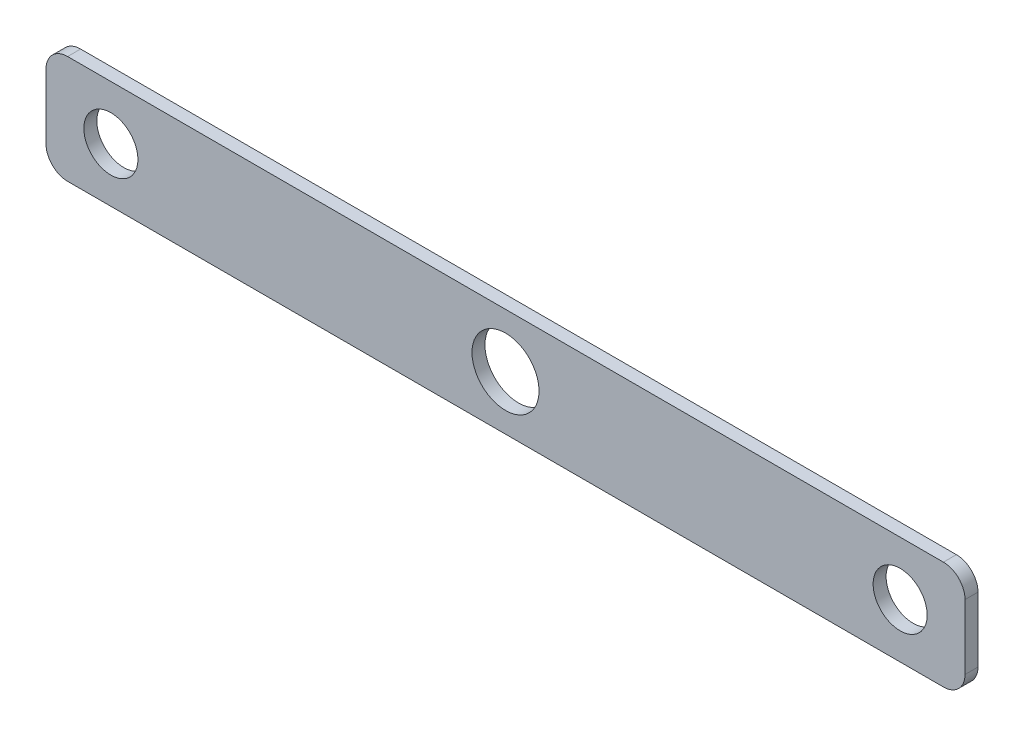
ISO-10303-21;
HEADER;
FILE_DESCRIPTION(('STEP AP214'),'2;1');
FILE_NAME('part.step','',(''),(''),'','','');
FILE_SCHEMA(('AUTOMOTIVE_DESIGN { 1 0 10303 214 1 1 1 1 }'));
ENDSEC;
DATA;
#1=APPLICATION_CONTEXT('core data for automotive mechanical design processes');
#2=APPLICATION_PROTOCOL_DEFINITION('international standard','automotive_design',2000,#1);
#3=PRODUCT_CONTEXT('',#1,'mechanical');
#4=PRODUCT('Part','Part','',(#3));
#5=PRODUCT_RELATED_PRODUCT_CATEGORY('part','',(#4));
#6=PRODUCT_DEFINITION_FORMATION('','',#4);
#7=PRODUCT_DEFINITION_CONTEXT('part definition',#1,'design');
#8=PRODUCT_DEFINITION('design','',#6,#7);
#9=PRODUCT_DEFINITION_SHAPE('','',#8);
#10=(LENGTH_UNIT() NAMED_UNIT(*) SI_UNIT(.MILLI.,.METRE.));
#11=(NAMED_UNIT(*) PLANE_ANGLE_UNIT() SI_UNIT($,.RADIAN.));
#12=(NAMED_UNIT(*) SI_UNIT($,.STERADIAN.) SOLID_ANGLE_UNIT());
#13=UNCERTAINTY_MEASURE_WITH_UNIT(LENGTH_MEASURE(1.E-05),#10,'distance_accuracy_value','');
#14=(GEOMETRIC_REPRESENTATION_CONTEXT(3) GLOBAL_UNCERTAINTY_ASSIGNED_CONTEXT((#13)) GLOBAL_UNIT_ASSIGNED_CONTEXT((#10,
#11,#12)) REPRESENTATION_CONTEXT('',''));
#15=CARTESIAN_POINT('',(0.,0.,0.));
#16=DIRECTION('',(0.,0.,1.));
#17=DIRECTION('',(1.,0.,0.));
#18=AXIS2_PLACEMENT_3D('',#15,#16,#17);
#19=CARTESIAN_POINT('',(-107.95,-12.7,1.524));
#20=DIRECTION('',(0.,0.,1.));
#21=DIRECTION('',(1.,0.,0.));
#22=AXIS2_PLACEMENT_3D('',#19,#20,#21);
#23=PLANE('',#22);
#24=CARTESIAN_POINT('',(0.,0.,1.524));
#25=DIRECTION('',(0.,0.,1.));
#26=DIRECTION('',(1.,0.,0.));
#27=AXIS2_PLACEMENT_3D('',#24,#25,#26);
#28=CIRCLE('',#27,7.87399999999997);
#29=CARTESIAN_POINT('',(-7.87399999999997,0.,1.524));
#30=VERTEX_POINT('',#29);
#31=EDGE_CURVE('E176',#30,#30,#28,.T.);
#32=ORIENTED_EDGE('',*,*,#31,.F.);
#33=EDGE_LOOP('',(#32));
#34=FACE_BOUND('',#33,.T.);
#35=DIRECTION('',(0.,1.,0.));
#36=VECTOR('',#35,1.);
#37=CARTESIAN_POINT('',(107.95,-12.7,1.524));
#38=LINE('',#37,#36);
#39=CARTESIAN_POINT('',(107.95,-7.61999999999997,1.524));
#40=VERTEX_POINT('',#39);
#41=CARTESIAN_POINT('',(107.95,7.62000000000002,1.524));
#42=VERTEX_POINT('',#41);
#43=EDGE_CURVE('E171',#40,#42,#38,.T.);
#44=ORIENTED_EDGE('',*,*,#43,.T.);
#45=CARTESIAN_POINT('',(102.87,7.62000000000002,1.524));
#46=DIRECTION('',(0.,0.,1.));
#47=DIRECTION('',(1.,0.,0.));
#48=AXIS2_PLACEMENT_3D('',#45,#46,#47);
#49=CIRCLE('',#48,5.08);
#50=CARTESIAN_POINT('',(102.87,12.7,1.524));
#51=VERTEX_POINT('',#50);
#52=EDGE_CURVE('E148',#42,#51,#49,.T.);
#53=ORIENTED_EDGE('',*,*,#52,.T.);
#54=DIRECTION('',(-1.,0.,0.));
#55=VECTOR('',#54,1.);
#56=CARTESIAN_POINT('',(107.95,12.7,1.524));
#57=LINE('',#56,#55);
#58=CARTESIAN_POINT('',(-102.87,12.7,1.524));
#59=VERTEX_POINT('',#58);
#60=EDGE_CURVE('E119',#51,#59,#57,.T.);
#61=ORIENTED_EDGE('',*,*,#60,.T.);
#62=CARTESIAN_POINT('',(-102.87,7.62,1.524));
#63=DIRECTION('',(0.,0.,1.));
#64=DIRECTION('',(1.,0.,0.));
#65=AXIS2_PLACEMENT_3D('',#62,#63,#64);
#66=CIRCLE('',#65,5.08);
#67=CARTESIAN_POINT('',(-107.95,7.62,1.524));
#68=VERTEX_POINT('',#67);
#69=EDGE_CURVE('E143',#59,#68,#66,.T.);
#70=ORIENTED_EDGE('',*,*,#69,.T.);
#71=DIRECTION('',(0.,-1.,0.));
#72=VECTOR('',#71,1.);
#73=CARTESIAN_POINT('',(-107.95,12.7,1.524));
#74=LINE('',#73,#72);
#75=CARTESIAN_POINT('',(-107.95,-7.61999999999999,1.524));
#76=VERTEX_POINT('',#75);
#77=EDGE_CURVE('E126',#68,#76,#74,.T.);
#78=ORIENTED_EDGE('',*,*,#77,.T.);
#79=CARTESIAN_POINT('',(-102.87,-7.61999999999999,1.524));
#80=DIRECTION('',(0.,0.,1.));
#81=DIRECTION('',(1.,0.,0.));
#82=AXIS2_PLACEMENT_3D('',#79,#80,#81);
#83=CIRCLE('',#82,5.08);
#84=CARTESIAN_POINT('',(-102.87,-12.7,1.524));
#85=VERTEX_POINT('',#84);
#86=EDGE_CURVE('E55',#76,#85,#83,.T.);
#87=ORIENTED_EDGE('',*,*,#86,.T.);
#88=DIRECTION('',(1.,0.,0.));
#89=VECTOR('',#88,1.);
#90=CARTESIAN_POINT('',(-107.95,-12.7,1.524));
#91=LINE('',#90,#89);
#92=CARTESIAN_POINT('',(102.87,-12.7,1.524));
#93=VERTEX_POINT('',#92);
#94=EDGE_CURVE('E129',#85,#93,#91,.T.);
#95=ORIENTED_EDGE('',*,*,#94,.T.);
#96=CARTESIAN_POINT('',(102.87,-7.61999999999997,1.524));
#97=DIRECTION('',(0.,0.,1.));
#98=DIRECTION('',(1.,0.,0.));
#99=AXIS2_PLACEMENT_3D('',#96,#97,#98);
#100=CIRCLE('',#99,5.08);
#101=EDGE_CURVE('E146',#93,#40,#100,.T.);
#102=ORIENTED_EDGE('',*,*,#101,.T.);
#103=EDGE_LOOP('',(#44,#53,#61,#70,#78,#87,#95,#102));
#104=FACE_BOUND('',#103,.T.);
#105=CARTESIAN_POINT('',(92.7100000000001,0.,1.524));
#106=DIRECTION('',(0.,0.,1.));
#107=DIRECTION('',(1.,0.,0.));
#108=AXIS2_PLACEMENT_3D('',#105,#106,#107);
#109=CIRCLE('',#108,6.35);
#110=CARTESIAN_POINT('',(86.3600000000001,0.,1.524));
#111=VERTEX_POINT('',#110);
#112=EDGE_CURVE('E164',#111,#111,#109,.T.);
#113=ORIENTED_EDGE('',*,*,#112,.F.);
#114=EDGE_LOOP('',(#113));
#115=FACE_BOUND('',#114,.T.);
#116=CARTESIAN_POINT('',(-92.71,0.,1.524));
#117=DIRECTION('',(0.,0.,1.));
#118=DIRECTION('',(1.,0.,0.));
#119=AXIS2_PLACEMENT_3D('',#116,#117,#118);
#120=CIRCLE('',#119,6.35);
#121=CARTESIAN_POINT('',(-99.06,0.,1.524));
#122=VERTEX_POINT('',#121);
#123=EDGE_CURVE('E181',#122,#122,#120,.T.);
#124=ORIENTED_EDGE('',*,*,#123,.F.);
#125=EDGE_LOOP('',(#124));
#126=FACE_BOUND('',#125,.T.);
#127=ADVANCED_FACE('F33',(#34,#104,#115,#126),#23,.T.);
#128=CARTESIAN_POINT('',(-107.95,-12.7,-1.524));
#129=DIRECTION('',(0.,0.,1.));
#130=DIRECTION('',(1.,0.,0.));
#131=AXIS2_PLACEMENT_3D('',#128,#129,#130);
#132=PLANE('',#131);
#133=CARTESIAN_POINT('',(0.,0.,-1.524));
#134=DIRECTION('',(0.,0.,1.));
#135=DIRECTION('',(1.,0.,0.));
#136=AXIS2_PLACEMENT_3D('',#133,#134,#135);
#137=CIRCLE('',#136,7.87399999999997);
#138=CARTESIAN_POINT('',(-7.87399999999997,0.,-1.524));
#139=VERTEX_POINT('',#138);
#140=EDGE_CURVE('E178',#139,#139,#137,.T.);
#141=ORIENTED_EDGE('',*,*,#140,.T.);
#142=EDGE_LOOP('',(#141));
#143=FACE_BOUND('',#142,.T.);
#144=DIRECTION('',(-1.,0.,0.));
#145=VECTOR('',#144,1.);
#146=CARTESIAN_POINT('',(107.95,12.7,-1.524));
#147=LINE('',#146,#145);
#148=CARTESIAN_POINT('',(102.87,12.7,-1.524));
#149=VERTEX_POINT('',#148);
#150=CARTESIAN_POINT('',(-102.87,12.7,-1.524));
#151=VERTEX_POINT('',#150);
#152=EDGE_CURVE('E116',#149,#151,#147,.T.);
#153=ORIENTED_EDGE('',*,*,#152,.F.);
#154=CARTESIAN_POINT('',(102.87,7.62000000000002,-1.524));
#155=DIRECTION('',(0.,0.,1.));
#156=DIRECTION('',(1.,0.,0.));
#157=AXIS2_PLACEMENT_3D('',#154,#155,#156);
#158=CIRCLE('',#157,5.08);
#159=CARTESIAN_POINT('',(107.95,7.62000000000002,-1.524));
#160=VERTEX_POINT('',#159);
#161=EDGE_CURVE('E99',#149,#160,#158,.F.);
#162=ORIENTED_EDGE('',*,*,#161,.T.);
#163=DIRECTION('',(0.,1.,0.));
#164=VECTOR('',#163,1.);
#165=CARTESIAN_POINT('',(107.95,-12.7,-1.524));
#166=LINE('',#165,#164);
#167=CARTESIAN_POINT('',(107.95,-7.61999999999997,-1.524));
#168=VERTEX_POINT('',#167);
#169=EDGE_CURVE('E127',#168,#160,#166,.T.);
#170=ORIENTED_EDGE('',*,*,#169,.F.);
#171=CARTESIAN_POINT('',(102.87,-7.61999999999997,-1.524));
#172=DIRECTION('',(0.,0.,1.));
#173=DIRECTION('',(1.,0.,0.));
#174=AXIS2_PLACEMENT_3D('',#171,#172,#173);
#175=CIRCLE('',#174,5.08);
#176=CARTESIAN_POINT('',(102.87,-12.7,-1.524));
#177=VERTEX_POINT('',#176);
#178=EDGE_CURVE('E110',#168,#177,#175,.F.);
#179=ORIENTED_EDGE('',*,*,#178,.T.);
#180=DIRECTION('',(1.,0.,0.));
#181=VECTOR('',#180,1.);
#182=CARTESIAN_POINT('',(-107.95,-12.7,-1.524));
#183=LINE('',#182,#181);
#184=CARTESIAN_POINT('',(-102.87,-12.7,-1.524));
#185=VERTEX_POINT('',#184);
#186=EDGE_CURVE('E131',#185,#177,#183,.T.);
#187=ORIENTED_EDGE('',*,*,#186,.F.);
#188=CARTESIAN_POINT('',(-102.87,-7.61999999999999,-1.524));
#189=DIRECTION('',(0.,0.,1.));
#190=DIRECTION('',(1.,0.,0.));
#191=AXIS2_PLACEMENT_3D('',#188,#189,#190);
#192=CIRCLE('',#191,5.08);
#193=CARTESIAN_POINT('',(-107.95,-7.61999999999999,-1.524));
#194=VERTEX_POINT('',#193);
#195=EDGE_CURVE('E137',#185,#194,#192,.F.);
#196=ORIENTED_EDGE('',*,*,#195,.T.);
#197=DIRECTION('',(0.,-1.,0.));
#198=VECTOR('',#197,1.);
#199=CARTESIAN_POINT('',(-107.95,12.7,-1.524));
#200=LINE('',#199,#198);
#201=CARTESIAN_POINT('',(-107.95,7.62,-1.524));
#202=VERTEX_POINT('',#201);
#203=EDGE_CURVE('E159',#202,#194,#200,.T.);
#204=ORIENTED_EDGE('',*,*,#203,.F.);
#205=CARTESIAN_POINT('',(-102.87,7.62,-1.524));
#206=DIRECTION('',(0.,0.,1.));
#207=DIRECTION('',(1.,0.,0.));
#208=AXIS2_PLACEMENT_3D('',#205,#206,#207);
#209=CIRCLE('',#208,5.08);
#210=EDGE_CURVE('E120',#202,#151,#209,.F.);
#211=ORIENTED_EDGE('',*,*,#210,.T.);
#212=EDGE_LOOP('',(#153,#162,#170,#179,#187,#196,#204,#211));
#213=FACE_BOUND('',#212,.T.);
#214=CARTESIAN_POINT('',(92.7100000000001,0.,-1.524));
#215=DIRECTION('',(0.,0.,1.));
#216=DIRECTION('',(1.,0.,0.));
#217=AXIS2_PLACEMENT_3D('',#214,#215,#216);
#218=CIRCLE('',#217,6.35);
#219=CARTESIAN_POINT('',(86.3600000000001,0.,-1.524));
#220=VERTEX_POINT('',#219);
#221=EDGE_CURVE('E167',#220,#220,#218,.T.);
#222=ORIENTED_EDGE('',*,*,#221,.T.);
#223=EDGE_LOOP('',(#222));
#224=FACE_BOUND('',#223,.T.);
#225=CARTESIAN_POINT('',(-92.71,0.,-1.524));
#226=DIRECTION('',(0.,0.,1.));
#227=DIRECTION('',(1.,0.,0.));
#228=AXIS2_PLACEMENT_3D('',#225,#226,#227);
#229=CIRCLE('',#228,6.35);
#230=CARTESIAN_POINT('',(-99.06,0.,-1.524));
#231=VERTEX_POINT('',#230);
#232=EDGE_CURVE('E184',#231,#231,#229,.T.);
#233=ORIENTED_EDGE('',*,*,#232,.T.);
#234=EDGE_LOOP('',(#233));
#235=FACE_BOUND('',#234,.T.);
#236=ADVANCED_FACE('F123',(#143,#213,#224,#235),#132,.F.);
#237=CARTESIAN_POINT('',(-107.95,12.7,1.524));
#238=DIRECTION('',(1.,0.,0.));
#239=DIRECTION('',(0.,0.,-1.));
#240=AXIS2_PLACEMENT_3D('',#237,#238,#239);
#241=PLANE('',#240);
#242=ORIENTED_EDGE('',*,*,#203,.T.);
#243=DIRECTION('',(0.,0.,-1.));
#244=VECTOR('',#243,1.);
#245=CARTESIAN_POINT('',(-107.95,-7.61999999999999,1.524));
#246=LINE('',#245,#244);
#247=EDGE_CURVE('E11',#194,#76,#246,.F.);
#248=ORIENTED_EDGE('',*,*,#247,.T.);
#249=ORIENTED_EDGE('',*,*,#77,.F.);
#250=DIRECTION('',(0.,0.,-1.));
#251=VECTOR('',#250,1.);
#252=CARTESIAN_POINT('',(-107.95,7.62,1.524));
#253=LINE('',#252,#251);
#254=EDGE_CURVE('E41',#68,#202,#253,.T.);
#255=ORIENTED_EDGE('',*,*,#254,.T.);
#256=EDGE_LOOP('',(#242,#248,#249,#255));
#257=FACE_BOUND('',#256,.T.);
#258=ADVANCED_FACE('F158',(#257),#241,.F.);
#259=CARTESIAN_POINT('',(-107.95,-12.7,1.524));
#260=DIRECTION('',(0.,1.,0.));
#261=DIRECTION('',(-1.,0.,0.));
#262=AXIS2_PLACEMENT_3D('',#259,#260,#261);
#263=PLANE('',#262);
#264=ORIENTED_EDGE('',*,*,#186,.T.);
#265=DIRECTION('',(0.,0.,-1.));
#266=VECTOR('',#265,1.);
#267=CARTESIAN_POINT('',(102.87,-12.7,1.524));
#268=LINE('',#267,#266);
#269=EDGE_CURVE('E48',#177,#93,#268,.F.);
#270=ORIENTED_EDGE('',*,*,#269,.T.);
#271=ORIENTED_EDGE('',*,*,#94,.F.);
#272=DIRECTION('',(0.,0.,-1.));
#273=VECTOR('',#272,1.);
#274=CARTESIAN_POINT('',(-102.87,-12.7,1.524));
#275=LINE('',#274,#273);
#276=EDGE_CURVE('E150',#85,#185,#275,.T.);
#277=ORIENTED_EDGE('',*,*,#276,.T.);
#278=EDGE_LOOP('',(#264,#270,#271,#277));
#279=FACE_BOUND('',#278,.T.);
#280=ADVANCED_FACE('F211',(#279),#263,.F.);
#281=CARTESIAN_POINT('',(107.95,-12.7,1.524));
#282=DIRECTION('',(-1.,0.,0.));
#283=DIRECTION('',(0.,-1.,0.));
#284=AXIS2_PLACEMENT_3D('',#281,#282,#283);
#285=PLANE('',#284);
#286=ORIENTED_EDGE('',*,*,#169,.T.);
#287=DIRECTION('',(0.,0.,-1.));
#288=VECTOR('',#287,1.);
#289=CARTESIAN_POINT('',(107.95,7.62000000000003,1.524));
#290=LINE('',#289,#288);
#291=EDGE_CURVE('E104',#160,#42,#290,.F.);
#292=ORIENTED_EDGE('',*,*,#291,.T.);
#293=ORIENTED_EDGE('',*,*,#43,.F.);
#294=DIRECTION('',(0.,0.,-1.));
#295=VECTOR('',#294,1.);
#296=CARTESIAN_POINT('',(107.95,-7.61999999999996,1.524));
#297=LINE('',#296,#295);
#298=EDGE_CURVE('E109',#40,#168,#297,.T.);
#299=ORIENTED_EDGE('',*,*,#298,.T.);
#300=EDGE_LOOP('',(#286,#292,#293,#299));
#301=FACE_BOUND('',#300,.T.);
#302=ADVANCED_FACE('F208',(#301),#285,.F.);
#303=CARTESIAN_POINT('',(107.95,12.7,1.524));
#304=DIRECTION('',(0.,-1.,0.));
#305=DIRECTION('',(1.,0.,0.));
#306=AXIS2_PLACEMENT_3D('',#303,#304,#305);
#307=PLANE('',#306);
#308=ORIENTED_EDGE('',*,*,#60,.F.);
#309=DIRECTION('',(0.,0.,-1.));
#310=VECTOR('',#309,1.);
#311=CARTESIAN_POINT('',(102.87,12.7,1.524));
#312=LINE('',#311,#310);
#313=EDGE_CURVE('E103',#51,#149,#312,.T.);
#314=ORIENTED_EDGE('',*,*,#313,.T.);
#315=ORIENTED_EDGE('',*,*,#152,.T.);
#316=DIRECTION('',(0.,0.,-1.));
#317=VECTOR('',#316,1.);
#318=CARTESIAN_POINT('',(-102.87,12.7,1.524));
#319=LINE('',#318,#317);
#320=EDGE_CURVE('E121',#151,#59,#319,.F.);
#321=ORIENTED_EDGE('',*,*,#320,.T.);
#322=EDGE_LOOP('',(#308,#314,#315,#321));
#323=FACE_BOUND('',#322,.T.);
#324=ADVANCED_FACE('F115',(#323),#307,.F.);
#325=CARTESIAN_POINT('',(92.7100000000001,0.,1.524));
#326=DIRECTION('',(0.,0.,-1.));
#327=DIRECTION('',(-1.,0.,0.));
#328=AXIS2_PLACEMENT_3D('',#325,#326,#327);
#329=CYLINDRICAL_SURFACE('',#328,6.35);
#330=CARTESIAN_POINT('',(86.3600000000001,0.,1.524));
#331=CARTESIAN_POINT('',(86.3600000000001,0.,1.49225));
#332=CARTESIAN_POINT('',(86.3600000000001,0.,1.4605));
#333=CARTESIAN_POINT('',(86.3600000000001,0.,1.397));
#334=CARTESIAN_POINT('',(86.3600000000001,0.,1.36525));
#335=CARTESIAN_POINT('',(86.3600000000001,0.,1.30175));
#336=CARTESIAN_POINT('',(86.3600000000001,0.,1.27));
#337=CARTESIAN_POINT('',(86.3600000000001,0.,1.2065));
#338=CARTESIAN_POINT('',(86.3600000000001,0.,1.17475));
#339=CARTESIAN_POINT('',(86.3600000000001,0.,1.11125));
#340=CARTESIAN_POINT('',(86.3600000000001,0.,1.0795));
#341=CARTESIAN_POINT('',(86.3600000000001,0.,1.016));
#342=CARTESIAN_POINT('',(86.3600000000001,0.,0.98425));
#343=CARTESIAN_POINT('',(86.3600000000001,0.,0.92075));
#344=CARTESIAN_POINT('',(86.3600000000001,0.,0.889));
#345=CARTESIAN_POINT('',(86.3600000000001,0.,0.8255));
#346=CARTESIAN_POINT('',(86.3600000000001,0.,0.79375));
#347=CARTESIAN_POINT('',(86.3600000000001,0.,0.73025));
#348=CARTESIAN_POINT('',(86.3600000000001,0.,0.6985));
#349=CARTESIAN_POINT('',(86.3600000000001,0.,0.635));
#350=CARTESIAN_POINT('',(86.3600000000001,0.,0.60325));
#351=CARTESIAN_POINT('',(86.3600000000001,0.,0.53975));
#352=CARTESIAN_POINT('',(86.3600000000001,0.,0.508));
#353=CARTESIAN_POINT('',(86.3600000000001,0.,0.4445));
#354=CARTESIAN_POINT('',(86.3600000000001,0.,0.41275));
#355=CARTESIAN_POINT('',(86.3600000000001,0.,0.34925));
#356=CARTESIAN_POINT('',(86.3600000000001,0.,0.3175));
#357=CARTESIAN_POINT('',(86.3600000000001,0.,0.254));
#358=CARTESIAN_POINT('',(86.3600000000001,0.,0.22225));
#359=CARTESIAN_POINT('',(86.3600000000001,0.,0.15875));
#360=CARTESIAN_POINT('',(86.3600000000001,0.,0.127));
#361=CARTESIAN_POINT('',(86.3600000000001,0.,0.0634999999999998));
#362=CARTESIAN_POINT('',(86.3600000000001,0.,0.0317499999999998));
#363=CARTESIAN_POINT('',(86.3600000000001,0.,-0.0317500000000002));
#364=CARTESIAN_POINT('',(86.3600000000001,0.,-0.0635000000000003));
#365=CARTESIAN_POINT('',(86.3600000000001,0.,-0.127));
#366=CARTESIAN_POINT('',(86.3600000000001,0.,-0.15875));
#367=CARTESIAN_POINT('',(86.3600000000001,0.,-0.22225));
#368=CARTESIAN_POINT('',(86.3600000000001,0.,-0.254));
#369=CARTESIAN_POINT('',(86.3600000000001,0.,-0.3175));
#370=CARTESIAN_POINT('',(86.3600000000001,0.,-0.34925));
#371=CARTESIAN_POINT('',(86.3600000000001,0.,-0.41275));
#372=CARTESIAN_POINT('',(86.3600000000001,0.,-0.4445));
#373=CARTESIAN_POINT('',(86.3600000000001,0.,-0.508));
#374=CARTESIAN_POINT('',(86.3600000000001,0.,-0.53975));
#375=CARTESIAN_POINT('',(86.3600000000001,0.,-0.60325));
#376=CARTESIAN_POINT('',(86.3600000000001,0.,-0.635));
#377=CARTESIAN_POINT('',(86.3600000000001,0.,-0.6985));
#378=CARTESIAN_POINT('',(86.3600000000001,0.,-0.73025));
#379=CARTESIAN_POINT('',(86.3600000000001,0.,-0.79375));
#380=CARTESIAN_POINT('',(86.3600000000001,0.,-0.8255));
#381=CARTESIAN_POINT('',(86.3600000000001,0.,-0.889));
#382=CARTESIAN_POINT('',(86.3600000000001,0.,-0.92075));
#383=CARTESIAN_POINT('',(86.3600000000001,0.,-0.98425));
#384=CARTESIAN_POINT('',(86.3600000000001,0.,-1.016));
#385=CARTESIAN_POINT('',(86.3600000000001,0.,-1.0795));
#386=CARTESIAN_POINT('',(86.3600000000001,0.,-1.11125));
#387=CARTESIAN_POINT('',(86.3600000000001,0.,-1.17475));
#388=CARTESIAN_POINT('',(86.3600000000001,0.,-1.2065));
#389=CARTESIAN_POINT('',(86.3600000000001,0.,-1.27));
#390=CARTESIAN_POINT('',(86.3600000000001,0.,-1.30175));
#391=CARTESIAN_POINT('',(86.3600000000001,0.,-1.36525));
#392=CARTESIAN_POINT('',(86.3600000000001,0.,-1.397));
#393=CARTESIAN_POINT('',(86.3600000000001,0.,-1.4605));
#394=CARTESIAN_POINT('',(86.3600000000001,0.,-1.49225));
#395=CARTESIAN_POINT('',(86.3600000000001,0.,-1.524));
#396=B_SPLINE_CURVE_WITH_KNOTS('',3,(#330,#331,#332,#333,#334,#335,#336,#337,#338,#339,#340,
#341,#342,#343,#344,#345,#346,#347,#348,#349,#350,#351,#352,#353,#354,#355,#356,#357,#358,#359,
#360,#361,#362,#363,#364,#365,#366,#367,#368,#369,#370,#371,#372,#373,#374,#375,#376,#377,#378,
#379,#380,#381,#382,#383,#384,#385,#386,#387,#388,#389,#390,#391,#392,#393,#394,#395),
.UNSPECIFIED.,.F.,.F.,(4,2,2,2,2,2,2,2,2,2,2,2,2,2,2,2,2,2,2,2,2,2,2,2,2,2,2,2,2,2,2,2,4),(0.,
0.0952499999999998,0.1905,0.28575,0.381,0.47625,0.5715,0.66675,0.762,0.85725,0.9525,1.04775,
1.143,1.23825,1.3335,1.42875,1.524,1.61925,1.7145,1.80975,1.905,2.00025,2.0955,2.19075,2.286,
2.38125,2.4765,2.57175,2.667,2.76225,2.8575,2.95275,3.048),.UNSPECIFIED.);
#397=EDGE_CURVE('BSEAM203',#111,#220,#396,.T.);
#398=ORIENTED_EDGE('',*,*,#112,.T.);
#399=ORIENTED_EDGE('',*,*,#221,.F.);
#400=ORIENTED_EDGE('',*,*,#397,.T.);
#401=ORIENTED_EDGE('',*,*,#397,.F.);
#402=EDGE_LOOP('',(#398,#400,#399,#401));
#403=FACE_BOUND('',#402,.T.);
#404=ADVANCED_FACE('F203',(#403),#329,.F.);
#405=CARTESIAN_POINT('',(0.,0.,1.524));
#406=DIRECTION('',(0.,0.,-1.));
#407=DIRECTION('',(-1.,0.,0.));
#408=AXIS2_PLACEMENT_3D('',#405,#406,#407);
#409=CYLINDRICAL_SURFACE('',#408,7.87399999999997);
#410=CARTESIAN_POINT('',(-7.87399999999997,0.,1.524));
#411=CARTESIAN_POINT('',(-7.87399999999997,0.,1.49225));
#412=CARTESIAN_POINT('',(-7.87399999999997,0.,1.4605));
#413=CARTESIAN_POINT('',(-7.87399999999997,0.,1.397));
#414=CARTESIAN_POINT('',(-7.87399999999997,0.,1.36525));
#415=CARTESIAN_POINT('',(-7.87399999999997,0.,1.30175));
#416=CARTESIAN_POINT('',(-7.87399999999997,0.,1.27));
#417=CARTESIAN_POINT('',(-7.87399999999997,0.,1.2065));
#418=CARTESIAN_POINT('',(-7.87399999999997,0.,1.17475));
#419=CARTESIAN_POINT('',(-7.87399999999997,0.,1.11125));
#420=CARTESIAN_POINT('',(-7.87399999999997,0.,1.0795));
#421=CARTESIAN_POINT('',(-7.87399999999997,0.,1.016));
#422=CARTESIAN_POINT('',(-7.87399999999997,0.,0.98425));
#423=CARTESIAN_POINT('',(-7.87399999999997,0.,0.92075));
#424=CARTESIAN_POINT('',(-7.87399999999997,0.,0.889));
#425=CARTESIAN_POINT('',(-7.87399999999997,0.,0.8255));
#426=CARTESIAN_POINT('',(-7.87399999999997,0.,0.79375));
#427=CARTESIAN_POINT('',(-7.87399999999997,0.,0.73025));
#428=CARTESIAN_POINT('',(-7.87399999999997,0.,0.6985));
#429=CARTESIAN_POINT('',(-7.87399999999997,0.,0.635));
#430=CARTESIAN_POINT('',(-7.87399999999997,0.,0.60325));
#431=CARTESIAN_POINT('',(-7.87399999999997,0.,0.53975));
#432=CARTESIAN_POINT('',(-7.87399999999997,0.,0.508));
#433=CARTESIAN_POINT('',(-7.87399999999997,0.,0.4445));
#434=CARTESIAN_POINT('',(-7.87399999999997,0.,0.41275));
#435=CARTESIAN_POINT('',(-7.87399999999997,0.,0.34925));
#436=CARTESIAN_POINT('',(-7.87399999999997,0.,0.3175));
#437=CARTESIAN_POINT('',(-7.87399999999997,0.,0.254));
#438=CARTESIAN_POINT('',(-7.87399999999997,0.,0.22225));
#439=CARTESIAN_POINT('',(-7.87399999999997,0.,0.15875));
#440=CARTESIAN_POINT('',(-7.87399999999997,0.,0.127));
#441=CARTESIAN_POINT('',(-7.87399999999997,0.,0.0635000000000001));
#442=CARTESIAN_POINT('',(-7.87399999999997,0.,0.03175));
#443=CARTESIAN_POINT('',(-7.87399999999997,0.,-0.03175));
#444=CARTESIAN_POINT('',(-7.87399999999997,0.,-0.0635000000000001));
#445=CARTESIAN_POINT('',(-7.87399999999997,0.,-0.127));
#446=CARTESIAN_POINT('',(-7.87399999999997,0.,-0.15875));
#447=CARTESIAN_POINT('',(-7.87399999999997,0.,-0.22225));
#448=CARTESIAN_POINT('',(-7.87399999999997,0.,-0.254));
#449=CARTESIAN_POINT('',(-7.87399999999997,0.,-0.3175));
#450=CARTESIAN_POINT('',(-7.87399999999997,0.,-0.34925));
#451=CARTESIAN_POINT('',(-7.87399999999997,0.,-0.41275));
#452=CARTESIAN_POINT('',(-7.87399999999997,0.,-0.4445));
#453=CARTESIAN_POINT('',(-7.87399999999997,0.,-0.508));
#454=CARTESIAN_POINT('',(-7.87399999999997,0.,-0.53975));
#455=CARTESIAN_POINT('',(-7.87399999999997,0.,-0.60325));
#456=CARTESIAN_POINT('',(-7.87399999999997,0.,-0.635));
#457=CARTESIAN_POINT('',(-7.87399999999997,0.,-0.6985));
#458=CARTESIAN_POINT('',(-7.87399999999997,0.,-0.73025));
#459=CARTESIAN_POINT('',(-7.87399999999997,0.,-0.79375));
#460=CARTESIAN_POINT('',(-7.87399999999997,0.,-0.8255));
#461=CARTESIAN_POINT('',(-7.87399999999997,0.,-0.889));
#462=CARTESIAN_POINT('',(-7.87399999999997,0.,-0.92075));
#463=CARTESIAN_POINT('',(-7.87399999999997,0.,-0.98425));
#464=CARTESIAN_POINT('',(-7.87399999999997,0.,-1.016));
#465=CARTESIAN_POINT('',(-7.87399999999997,0.,-1.0795));
#466=CARTESIAN_POINT('',(-7.87399999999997,0.,-1.11125));
#467=CARTESIAN_POINT('',(-7.87399999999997,0.,-1.17475));
#468=CARTESIAN_POINT('',(-7.87399999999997,0.,-1.2065));
#469=CARTESIAN_POINT('',(-7.87399999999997,0.,-1.27));
#470=CARTESIAN_POINT('',(-7.87399999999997,0.,-1.30175));
#471=CARTESIAN_POINT('',(-7.87399999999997,0.,-1.36525));
#472=CARTESIAN_POINT('',(-7.87399999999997,0.,-1.397));
#473=CARTESIAN_POINT('',(-7.87399999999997,0.,-1.4605));
#474=CARTESIAN_POINT('',(-7.87399999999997,0.,-1.49225));
#475=CARTESIAN_POINT('',(-7.87399999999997,0.,-1.524));
#476=B_SPLINE_CURVE_WITH_KNOTS('',3,(#410,#411,#412,#413,#414,#415,#416,#417,#418,#419,#420,
#421,#422,#423,#424,#425,#426,#427,#428,#429,#430,#431,#432,#433,#434,#435,#436,#437,#438,#439,
#440,#441,#442,#443,#444,#445,#446,#447,#448,#449,#450,#451,#452,#453,#454,#455,#456,#457,#458,
#459,#460,#461,#462,#463,#464,#465,#466,#467,#468,#469,#470,#471,#472,#473,#474,#475),
.UNSPECIFIED.,.F.,.F.,(4,2,2,2,2,2,2,2,2,2,2,2,2,2,2,2,2,2,2,2,2,2,2,2,2,2,2,2,2,2,2,2,4),(0.,
0.0952500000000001,0.1905,0.28575,0.381,0.47625,0.5715,0.66675,0.762,0.85725,0.9525,1.04775,
1.143,1.23825,1.3335,1.42875,1.524,1.61925,1.7145,1.80975,1.905,2.00025,2.0955,2.19075,2.286,
2.38125,2.4765,2.57175,2.667,2.76225,2.8575,2.95275,3.048),.UNSPECIFIED.);
#477=EDGE_CURVE('BSEAM237',#30,#139,#476,.T.);
#478=ORIENTED_EDGE('',*,*,#31,.T.);
#479=ORIENTED_EDGE('',*,*,#140,.F.);
#480=ORIENTED_EDGE('',*,*,#477,.T.);
#481=ORIENTED_EDGE('',*,*,#477,.F.);
#482=EDGE_LOOP('',(#478,#480,#479,#481));
#483=FACE_BOUND('',#482,.T.);
#484=ADVANCED_FACE('F237',(#483),#409,.F.);
#485=CARTESIAN_POINT('',(-92.71,0.,1.524));
#486=DIRECTION('',(0.,0.,-1.));
#487=DIRECTION('',(-1.,0.,0.));
#488=AXIS2_PLACEMENT_3D('',#485,#486,#487);
#489=CYLINDRICAL_SURFACE('',#488,6.35);
#490=CARTESIAN_POINT('',(-99.06,0.,1.524));
#491=CARTESIAN_POINT('',(-99.06,0.,1.49225));
#492=CARTESIAN_POINT('',(-99.06,0.,1.4605));
#493=CARTESIAN_POINT('',(-99.06,0.,1.397));
#494=CARTESIAN_POINT('',(-99.06,0.,1.36525));
#495=CARTESIAN_POINT('',(-99.06,0.,1.30175));
#496=CARTESIAN_POINT('',(-99.06,0.,1.27));
#497=CARTESIAN_POINT('',(-99.06,0.,1.2065));
#498=CARTESIAN_POINT('',(-99.06,0.,1.17475));
#499=CARTESIAN_POINT('',(-99.06,0.,1.11125));
#500=CARTESIAN_POINT('',(-99.06,0.,1.0795));
#501=CARTESIAN_POINT('',(-99.06,0.,1.016));
#502=CARTESIAN_POINT('',(-99.06,0.,0.98425));
#503=CARTESIAN_POINT('',(-99.06,0.,0.92075));
#504=CARTESIAN_POINT('',(-99.06,0.,0.889));
#505=CARTESIAN_POINT('',(-99.06,0.,0.8255));
#506=CARTESIAN_POINT('',(-99.06,0.,0.79375));
#507=CARTESIAN_POINT('',(-99.06,0.,0.73025));
#508=CARTESIAN_POINT('',(-99.06,0.,0.6985));
#509=CARTESIAN_POINT('',(-99.06,0.,0.635));
#510=CARTESIAN_POINT('',(-99.06,0.,0.60325));
#511=CARTESIAN_POINT('',(-99.06,0.,0.53975));
#512=CARTESIAN_POINT('',(-99.06,0.,0.508));
#513=CARTESIAN_POINT('',(-99.06,0.,0.4445));
#514=CARTESIAN_POINT('',(-99.06,0.,0.41275));
#515=CARTESIAN_POINT('',(-99.06,0.,0.34925));
#516=CARTESIAN_POINT('',(-99.06,0.,0.3175));
#517=CARTESIAN_POINT('',(-99.06,0.,0.254));
#518=CARTESIAN_POINT('',(-99.06,0.,0.22225));
#519=CARTESIAN_POINT('',(-99.06,0.,0.15875));
#520=CARTESIAN_POINT('',(-99.06,0.,0.127));
#521=CARTESIAN_POINT('',(-99.06,0.,0.0634999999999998));
#522=CARTESIAN_POINT('',(-99.06,0.,0.0317499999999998));
#523=CARTESIAN_POINT('',(-99.06,0.,-0.0317500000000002));
#524=CARTESIAN_POINT('',(-99.06,0.,-0.0635000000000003));
#525=CARTESIAN_POINT('',(-99.06,0.,-0.127));
#526=CARTESIAN_POINT('',(-99.06,0.,-0.15875));
#527=CARTESIAN_POINT('',(-99.06,0.,-0.22225));
#528=CARTESIAN_POINT('',(-99.06,0.,-0.254));
#529=CARTESIAN_POINT('',(-99.06,0.,-0.3175));
#530=CARTESIAN_POINT('',(-99.06,0.,-0.34925));
#531=CARTESIAN_POINT('',(-99.06,0.,-0.41275));
#532=CARTESIAN_POINT('',(-99.06,0.,-0.4445));
#533=CARTESIAN_POINT('',(-99.06,0.,-0.508));
#534=CARTESIAN_POINT('',(-99.06,0.,-0.53975));
#535=CARTESIAN_POINT('',(-99.06,0.,-0.60325));
#536=CARTESIAN_POINT('',(-99.06,0.,-0.635));
#537=CARTESIAN_POINT('',(-99.06,0.,-0.6985));
#538=CARTESIAN_POINT('',(-99.06,0.,-0.73025));
#539=CARTESIAN_POINT('',(-99.06,0.,-0.79375));
#540=CARTESIAN_POINT('',(-99.06,0.,-0.8255));
#541=CARTESIAN_POINT('',(-99.06,0.,-0.889));
#542=CARTESIAN_POINT('',(-99.06,0.,-0.92075));
#543=CARTESIAN_POINT('',(-99.06,0.,-0.98425));
#544=CARTESIAN_POINT('',(-99.06,0.,-1.016));
#545=CARTESIAN_POINT('',(-99.06,0.,-1.0795));
#546=CARTESIAN_POINT('',(-99.06,0.,-1.11125));
#547=CARTESIAN_POINT('',(-99.06,0.,-1.17475));
#548=CARTESIAN_POINT('',(-99.06,0.,-1.2065));
#549=CARTESIAN_POINT('',(-99.06,0.,-1.27));
#550=CARTESIAN_POINT('',(-99.06,0.,-1.30175));
#551=CARTESIAN_POINT('',(-99.06,0.,-1.36525));
#552=CARTESIAN_POINT('',(-99.06,0.,-1.397));
#553=CARTESIAN_POINT('',(-99.06,0.,-1.4605));
#554=CARTESIAN_POINT('',(-99.06,0.,-1.49225));
#555=CARTESIAN_POINT('',(-99.06,0.,-1.524));
#556=B_SPLINE_CURVE_WITH_KNOTS('',3,(#490,#491,#492,#493,#494,#495,#496,#497,#498,#499,#500,
#501,#502,#503,#504,#505,#506,#507,#508,#509,#510,#511,#512,#513,#514,#515,#516,#517,#518,#519,
#520,#521,#522,#523,#524,#525,#526,#527,#528,#529,#530,#531,#532,#533,#534,#535,#536,#537,#538,
#539,#540,#541,#542,#543,#544,#545,#546,#547,#548,#549,#550,#551,#552,#553,#554,#555),
.UNSPECIFIED.,.F.,.F.,(4,2,2,2,2,2,2,2,2,2,2,2,2,2,2,2,2,2,2,2,2,2,2,2,2,2,2,2,2,2,2,2,4),(0.,
0.0952499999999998,0.1905,0.28575,0.381,0.47625,0.5715,0.66675,0.762,0.85725,0.9525,1.04775,
1.143,1.23825,1.3335,1.42875,1.524,1.61925,1.7145,1.80975,1.905,2.00025,2.0955,2.19075,2.286,
2.38125,2.4765,2.57175,2.667,2.76225,2.8575,2.95275,3.048),.UNSPECIFIED.);
#557=EDGE_CURVE('BSEAM190',#122,#231,#556,.T.);
#558=ORIENTED_EDGE('',*,*,#123,.T.);
#559=ORIENTED_EDGE('',*,*,#232,.F.);
#560=ORIENTED_EDGE('',*,*,#557,.T.);
#561=ORIENTED_EDGE('',*,*,#557,.F.);
#562=EDGE_LOOP('',(#558,#560,#559,#561));
#563=FACE_BOUND('',#562,.T.);
#564=ADVANCED_FACE('F190',(#563),#489,.F.);
#565=CARTESIAN_POINT('',(102.87,7.62000000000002,1.524));
#566=DIRECTION('',(0.,0.,-1.));
#567=DIRECTION('',(-1.,0.,0.));
#568=AXIS2_PLACEMENT_3D('',#565,#566,#567);
#569=CYLINDRICAL_SURFACE('',#568,5.08);
#570=ORIENTED_EDGE('',*,*,#52,.F.);
#571=ORIENTED_EDGE('',*,*,#291,.F.);
#572=ORIENTED_EDGE('',*,*,#161,.F.);
#573=ORIENTED_EDGE('',*,*,#313,.F.);
#574=EDGE_LOOP('',(#570,#571,#572,#573));
#575=FACE_BOUND('',#574,.T.);
#576=ADVANCED_FACE('F102',(#575),#569,.T.);
#577=CARTESIAN_POINT('',(102.87,-7.61999999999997,1.524));
#578=DIRECTION('',(0.,0.,-1.));
#579=DIRECTION('',(-1.,0.,0.));
#580=AXIS2_PLACEMENT_3D('',#577,#578,#579);
#581=CYLINDRICAL_SURFACE('',#580,5.08);
#582=ORIENTED_EDGE('',*,*,#101,.F.);
#583=ORIENTED_EDGE('',*,*,#269,.F.);
#584=ORIENTED_EDGE('',*,*,#178,.F.);
#585=ORIENTED_EDGE('',*,*,#298,.F.);
#586=EDGE_LOOP('',(#582,#583,#584,#585));
#587=FACE_BOUND('',#586,.T.);
#588=ADVANCED_FACE('F219',(#587),#581,.T.);
#589=CARTESIAN_POINT('',(-102.87,-7.61999999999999,1.524));
#590=DIRECTION('',(0.,0.,-1.));
#591=DIRECTION('',(-1.,0.,0.));
#592=AXIS2_PLACEMENT_3D('',#589,#590,#591);
#593=CYLINDRICAL_SURFACE('',#592,5.08);
#594=ORIENTED_EDGE('',*,*,#86,.F.);
#595=ORIENTED_EDGE('',*,*,#247,.F.);
#596=ORIENTED_EDGE('',*,*,#195,.F.);
#597=ORIENTED_EDGE('',*,*,#276,.F.);
#598=EDGE_LOOP('',(#594,#595,#596,#597));
#599=FACE_BOUND('',#598,.T.);
#600=ADVANCED_FACE('F221',(#599),#593,.T.);
#601=CARTESIAN_POINT('',(-102.87,7.62,1.524));
#602=DIRECTION('',(0.,0.,-1.));
#603=DIRECTION('',(-1.,0.,0.));
#604=AXIS2_PLACEMENT_3D('',#601,#602,#603);
#605=CYLINDRICAL_SURFACE('',#604,5.08);
#606=ORIENTED_EDGE('',*,*,#69,.F.);
#607=ORIENTED_EDGE('',*,*,#320,.F.);
#608=ORIENTED_EDGE('',*,*,#210,.F.);
#609=ORIENTED_EDGE('',*,*,#254,.F.);
#610=EDGE_LOOP('',(#606,#607,#608,#609));
#611=FACE_BOUND('',#610,.T.);
#612=ADVANCED_FACE('F35',(#611),#605,.T.);
#613=CLOSED_SHELL('',(#127,#236,#258,#280,#302,#324,#404,#484,#564,#576,#588,#600,#612));
#614=MANIFOLD_SOLID_BREP('B2',#613);
#615=ADVANCED_BREP_SHAPE_REPRESENTATION('',(#18,#614),#14);
#616=SHAPE_DEFINITION_REPRESENTATION(#9,#615);
ENDSEC;
END-ISO-10303-21;
